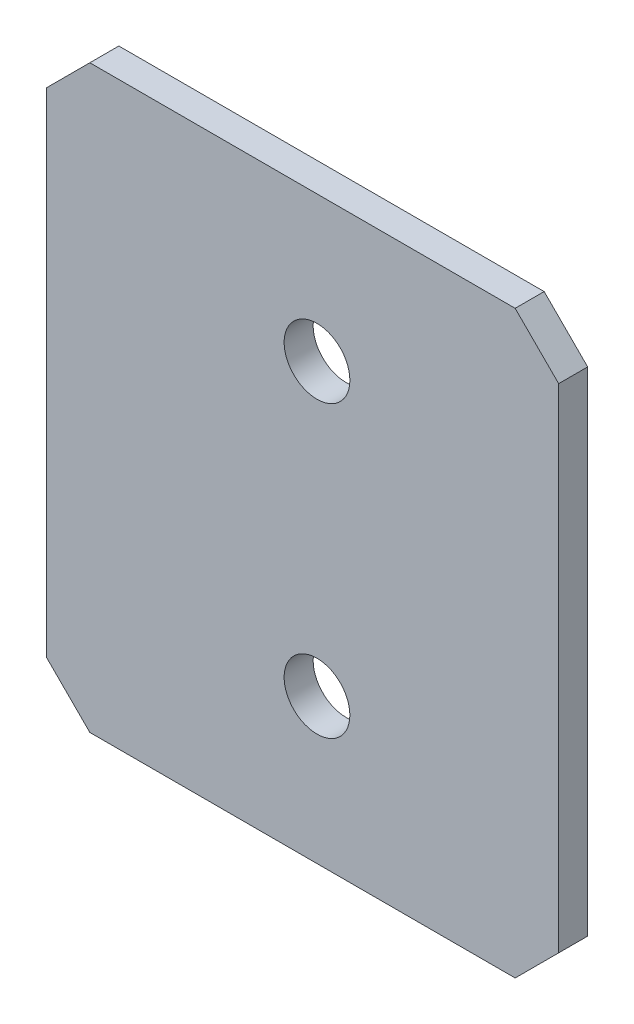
ISO-10303-21;
HEADER;
FILE_DESCRIPTION(('STEP AP214'),'2;1');
FILE_NAME('part.step','',(''),(''),'','','');
FILE_SCHEMA(('AUTOMOTIVE_DESIGN { 1 0 10303 214 1 1 1 1 }'));
ENDSEC;
DATA;
#1=APPLICATION_CONTEXT('core data for automotive mechanical design processes');
#2=APPLICATION_PROTOCOL_DEFINITION('international standard','automotive_design',2000,#1);
#3=PRODUCT_CONTEXT('',#1,'mechanical');
#4=PRODUCT('Part','Part','',(#3));
#5=PRODUCT_RELATED_PRODUCT_CATEGORY('part','',(#4));
#6=PRODUCT_DEFINITION_FORMATION('','',#4);
#7=PRODUCT_DEFINITION_CONTEXT('part definition',#1,'design');
#8=PRODUCT_DEFINITION('design','',#6,#7);
#9=PRODUCT_DEFINITION_SHAPE('','',#8);
#10=(LENGTH_UNIT() NAMED_UNIT(*) SI_UNIT(.MILLI.,.METRE.));
#11=(NAMED_UNIT(*) PLANE_ANGLE_UNIT() SI_UNIT($,.RADIAN.));
#12=(NAMED_UNIT(*) SI_UNIT($,.STERADIAN.) SOLID_ANGLE_UNIT());
#13=UNCERTAINTY_MEASURE_WITH_UNIT(LENGTH_MEASURE(1.E-05),#10,'distance_accuracy_value','');
#14=(GEOMETRIC_REPRESENTATION_CONTEXT(3) GLOBAL_UNCERTAINTY_ASSIGNED_CONTEXT((#13)) GLOBAL_UNIT_ASSIGNED_CONTEXT((#10,
#11,#12)) REPRESENTATION_CONTEXT('',''));
#15=CARTESIAN_POINT('',(0.,0.,0.));
#16=DIRECTION('',(0.,0.,1.));
#17=DIRECTION('',(1.,0.,0.));
#18=AXIS2_PLACEMENT_3D('',#15,#16,#17);
#19=CARTESIAN_POINT('',(0.,0.,3.));
#20=DIRECTION('',(1.,0.,0.));
#21=DIRECTION('',(0.,0.,-1.));
#22=AXIS2_PLACEMENT_3D('',#19,#20,#21);
#23=PLANE('',#22);
#24=DIRECTION('',(0.,-1.,0.));
#25=VECTOR('',#24,1.);
#26=CARTESIAN_POINT('',(0.,0.,3.));
#27=LINE('',#26,#25);
#28=CARTESIAN_POINT('',(0.,55.5,3.));
#29=VERTEX_POINT('',#28);
#30=CARTESIAN_POINT('',(0.,4.50000000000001,3.));
#31=VERTEX_POINT('',#30);
#32=EDGE_CURVE('E119',#29,#31,#27,.T.);
#33=ORIENTED_EDGE('',*,*,#32,.F.);
#34=DIRECTION('',(0.,0.,-1.));
#35=VECTOR('',#34,1.);
#36=CARTESIAN_POINT('',(0.,55.5,3.));
#37=LINE('',#36,#35);
#38=CARTESIAN_POINT('',(0.,55.5,0.));
#39=VERTEX_POINT('',#38);
#40=EDGE_CURVE('E104',#29,#39,#37,.T.);
#41=ORIENTED_EDGE('',*,*,#40,.T.);
#42=DIRECTION('',(0.,-1.,0.));
#43=VECTOR('',#42,1.);
#44=CARTESIAN_POINT('',(0.,0.,0.));
#45=LINE('',#44,#43);
#46=CARTESIAN_POINT('',(0.,4.50000000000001,0.));
#47=VERTEX_POINT('',#46);
#48=EDGE_CURVE('E116',#39,#47,#45,.T.);
#49=ORIENTED_EDGE('',*,*,#48,.T.);
#50=DIRECTION('',(0.,0.,1.));
#51=VECTOR('',#50,1.);
#52=CARTESIAN_POINT('',(0.,4.50000000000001,3.));
#53=LINE('',#52,#51);
#54=EDGE_CURVE('E121',#47,#31,#53,.T.);
#55=ORIENTED_EDGE('',*,*,#54,.T.);
#56=EDGE_LOOP('',(#33,#41,#49,#55));
#57=FACE_BOUND('',#56,.T.);
#58=ADVANCED_FACE('F34',(#57),#23,.F.);
#59=CARTESIAN_POINT('',(0.,0.,3.));
#60=DIRECTION('',(0.,1.,0.));
#61=DIRECTION('',(0.,0.,1.));
#62=AXIS2_PLACEMENT_3D('',#59,#60,#61);
#63=PLANE('',#62);
#64=DIRECTION('',(1.,0.,0.));
#65=VECTOR('',#64,1.);
#66=CARTESIAN_POINT('',(0.,0.,0.));
#67=LINE('',#66,#65);
#68=CARTESIAN_POINT('',(4.5,0.,0.));
#69=VERTEX_POINT('',#68);
#70=CARTESIAN_POINT('',(48.5,0.,0.));
#71=VERTEX_POINT('',#70);
#72=EDGE_CURVE('E125',#69,#71,#67,.T.);
#73=ORIENTED_EDGE('',*,*,#72,.T.);
#74=DIRECTION('',(0.,0.,1.));
#75=VECTOR('',#74,1.);
#76=CARTESIAN_POINT('',(48.5,0.,3.));
#77=LINE('',#76,#75);
#78=CARTESIAN_POINT('',(48.5,0.,3.));
#79=VERTEX_POINT('',#78);
#80=EDGE_CURVE('E11',#71,#79,#77,.T.);
#81=ORIENTED_EDGE('',*,*,#80,.T.);
#82=DIRECTION('',(1.,0.,0.));
#83=VECTOR('',#82,1.);
#84=CARTESIAN_POINT('',(0.,0.,3.));
#85=LINE('',#84,#83);
#86=CARTESIAN_POINT('',(4.49999999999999,0.,3.));
#87=VERTEX_POINT('',#86);
#88=EDGE_CURVE('E169',#87,#79,#85,.T.);
#89=ORIENTED_EDGE('',*,*,#88,.F.);
#90=DIRECTION('',(0.,0.,-1.));
#91=VECTOR('',#90,1.);
#92=CARTESIAN_POINT('',(4.49999999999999,0.,3.));
#93=LINE('',#92,#91);
#94=EDGE_CURVE('E42',#87,#69,#93,.T.);
#95=ORIENTED_EDGE('',*,*,#94,.T.);
#96=EDGE_LOOP('',(#73,#81,#89,#95));
#97=FACE_BOUND('',#96,.T.);
#98=ADVANCED_FACE('F167',(#97),#63,.F.);
#99=CARTESIAN_POINT('',(53.,0.,3.));
#100=DIRECTION('',(-1.,0.,0.));
#101=DIRECTION('',(0.,-1.,0.));
#102=AXIS2_PLACEMENT_3D('',#99,#100,#101);
#103=PLANE('',#102);
#104=DIRECTION('',(0.,1.,0.));
#105=VECTOR('',#104,1.);
#106=CARTESIAN_POINT('',(53.,0.,0.));
#107=LINE('',#106,#105);
#108=CARTESIAN_POINT('',(53.,4.5,0.));
#109=VERTEX_POINT('',#108);
#110=CARTESIAN_POINT('',(53.,55.5,0.));
#111=VERTEX_POINT('',#110);
#112=EDGE_CURVE('E129',#109,#111,#107,.T.);
#113=ORIENTED_EDGE('',*,*,#112,.T.);
#114=DIRECTION('',(0.,0.,1.));
#115=VECTOR('',#114,1.);
#116=CARTESIAN_POINT('',(53.,55.5,3.));
#117=LINE('',#116,#115);
#118=CARTESIAN_POINT('',(53.,55.5,3.));
#119=VERTEX_POINT('',#118);
#120=EDGE_CURVE('E49',#111,#119,#117,.T.);
#121=ORIENTED_EDGE('',*,*,#120,.T.);
#122=DIRECTION('',(0.,1.,0.));
#123=VECTOR('',#122,1.);
#124=CARTESIAN_POINT('',(53.,0.,3.));
#125=LINE('',#124,#123);
#126=CARTESIAN_POINT('',(53.,4.5,3.));
#127=VERTEX_POINT('',#126);
#128=EDGE_CURVE('E177',#127,#119,#125,.T.);
#129=ORIENTED_EDGE('',*,*,#128,.F.);
#130=DIRECTION('',(0.,0.,-1.));
#131=VECTOR('',#130,1.);
#132=CARTESIAN_POINT('',(53.,4.5,3.));
#133=LINE('',#132,#131);
#134=EDGE_CURVE('E160',#127,#109,#133,.T.);
#135=ORIENTED_EDGE('',*,*,#134,.T.);
#136=EDGE_LOOP('',(#113,#121,#129,#135));
#137=FACE_BOUND('',#136,.T.);
#138=ADVANCED_FACE('F176',(#137),#103,.F.);
#139=CARTESIAN_POINT('',(0.,60.,3.));
#140=DIRECTION('',(0.,-1.,0.));
#141=DIRECTION('',(0.,0.,-1.));
#142=AXIS2_PLACEMENT_3D('',#139,#140,#141);
#143=PLANE('',#142);
#144=DIRECTION('',(-1.,0.,0.));
#145=VECTOR('',#144,1.);
#146=CARTESIAN_POINT('',(0.,60.,0.));
#147=LINE('',#146,#145);
#148=CARTESIAN_POINT('',(48.5,60.,0.));
#149=VERTEX_POINT('',#148);
#150=CARTESIAN_POINT('',(4.50000000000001,60.,0.));
#151=VERTEX_POINT('',#150);
#152=EDGE_CURVE('E139',#149,#151,#147,.T.);
#153=ORIENTED_EDGE('',*,*,#152,.T.);
#154=DIRECTION('',(0.,0.,1.));
#155=VECTOR('',#154,1.);
#156=CARTESIAN_POINT('',(4.50000000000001,60.,3.));
#157=LINE('',#156,#155);
#158=CARTESIAN_POINT('',(4.50000000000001,60.,3.));
#159=VERTEX_POINT('',#158);
#160=EDGE_CURVE('E105',#151,#159,#157,.T.);
#161=ORIENTED_EDGE('',*,*,#160,.T.);
#162=DIRECTION('',(-1.,0.,0.));
#163=VECTOR('',#162,1.);
#164=CARTESIAN_POINT('',(0.,60.,3.));
#165=LINE('',#164,#163);
#166=CARTESIAN_POINT('',(48.5,60.,3.));
#167=VERTEX_POINT('',#166);
#168=EDGE_CURVE('E135',#167,#159,#165,.T.);
#169=ORIENTED_EDGE('',*,*,#168,.F.);
#170=DIRECTION('',(0.,0.,-1.));
#171=VECTOR('',#170,1.);
#172=CARTESIAN_POINT('',(48.5,60.,3.));
#173=LINE('',#172,#171);
#174=EDGE_CURVE('E110',#167,#149,#173,.T.);
#175=ORIENTED_EDGE('',*,*,#174,.T.);
#176=EDGE_LOOP('',(#153,#161,#169,#175));
#177=FACE_BOUND('',#176,.T.);
#178=ADVANCED_FACE('F193',(#177),#143,.F.);
#179=CARTESIAN_POINT('',(0.,60.,3.));
#180=DIRECTION('',(0.,0.,-1.));
#181=DIRECTION('',(-1.,0.,0.));
#182=AXIS2_PLACEMENT_3D('',#179,#180,#181);
#183=PLANE('',#182);
#184=CARTESIAN_POINT('',(28.,45.,3.));
#185=DIRECTION('',(0.,0.,1.));
#186=DIRECTION('',(1.,0.,0.));
#187=AXIS2_PLACEMENT_3D('',#184,#185,#186);
#188=CIRCLE('',#187,3.39999999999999);
#189=CARTESIAN_POINT('',(31.4,45.,3.));
#190=VERTEX_POINT('',#189);
#191=EDGE_CURVE('E144',#190,#190,#188,.T.);
#192=ORIENTED_EDGE('',*,*,#191,.F.);
#193=EDGE_LOOP('',(#192));
#194=FACE_BOUND('',#193,.T.);
#195=CARTESIAN_POINT('',(28.,15.,3.));
#196=DIRECTION('',(0.,0.,1.));
#197=DIRECTION('',(1.,0.,0.));
#198=AXIS2_PLACEMENT_3D('',#195,#196,#197);
#199=CIRCLE('',#198,3.4);
#200=CARTESIAN_POINT('',(31.4,15.,3.));
#201=VERTEX_POINT('',#200);
#202=EDGE_CURVE('E132',#201,#201,#199,.T.);
#203=ORIENTED_EDGE('',*,*,#202,.F.);
#204=EDGE_LOOP('',(#203));
#205=FACE_BOUND('',#204,.T.);
#206=ORIENTED_EDGE('',*,*,#168,.T.);
#207=DIRECTION('',(0.707106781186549,0.707106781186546,0.));
#208=VECTOR('',#207,1.);
#209=CARTESIAN_POINT('',(0.,55.5,3.));
#210=LINE('',#209,#208);
#211=EDGE_CURVE('E158',#159,#29,#210,.F.);
#212=ORIENTED_EDGE('',*,*,#211,.T.);
#213=ORIENTED_EDGE('',*,*,#32,.T.);
#214=DIRECTION('',(-0.707106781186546,0.707106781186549,0.));
#215=VECTOR('',#214,1.);
#216=CARTESIAN_POINT('',(4.49999999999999,0.,3.));
#217=LINE('',#216,#215);
#218=EDGE_CURVE('E153',#31,#87,#217,.F.);
#219=ORIENTED_EDGE('',*,*,#218,.T.);
#220=ORIENTED_EDGE('',*,*,#88,.T.);
#221=DIRECTION('',(-0.707106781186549,-0.707106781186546,0.));
#222=VECTOR('',#221,1.);
#223=CARTESIAN_POINT('',(53.,4.5,3.));
#224=LINE('',#223,#222);
#225=EDGE_CURVE('E56',#79,#127,#224,.F.);
#226=ORIENTED_EDGE('',*,*,#225,.T.);
#227=ORIENTED_EDGE('',*,*,#128,.T.);
#228=DIRECTION('',(0.707106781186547,-0.707106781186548,0.));
#229=VECTOR('',#228,1.);
#230=CARTESIAN_POINT('',(48.5,60.,3.));
#231=LINE('',#230,#229);
#232=EDGE_CURVE('E156',#119,#167,#231,.F.);
#233=ORIENTED_EDGE('',*,*,#232,.T.);
#234=EDGE_LOOP('',(#206,#212,#213,#219,#220,#226,#227,#233));
#235=FACE_BOUND('',#234,.T.);
#236=ADVANCED_FACE('F190',(#194,#205,#235),#183,.F.);
#237=CARTESIAN_POINT('',(0.,60.,0.));
#238=DIRECTION('',(0.,0.,-1.));
#239=DIRECTION('',(-1.,0.,0.));
#240=AXIS2_PLACEMENT_3D('',#237,#238,#239);
#241=PLANE('',#240);
#242=CARTESIAN_POINT('',(28.,45.,0.));
#243=DIRECTION('',(0.,0.,-1.));
#244=DIRECTION('',(-1.,0.,0.));
#245=AXIS2_PLACEMENT_3D('',#242,#243,#244);
#246=CIRCLE('',#245,3.39999999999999);
#247=CARTESIAN_POINT('',(24.6,45.,0.));
#248=VERTEX_POINT('',#247);
#249=EDGE_CURVE('E141',#248,#248,#246,.T.);
#250=ORIENTED_EDGE('',*,*,#249,.F.);
#251=EDGE_LOOP('',(#250));
#252=FACE_BOUND('',#251,.T.);
#253=CARTESIAN_POINT('',(28.,15.,0.));
#254=DIRECTION('',(0.,0.,-1.));
#255=DIRECTION('',(-1.,0.,0.));
#256=AXIS2_PLACEMENT_3D('',#253,#254,#255);
#257=CIRCLE('',#256,3.4);
#258=CARTESIAN_POINT('',(24.6,15.,0.));
#259=VERTEX_POINT('',#258);
#260=EDGE_CURVE('E126',#259,#259,#257,.T.);
#261=ORIENTED_EDGE('',*,*,#260,.F.);
#262=EDGE_LOOP('',(#261));
#263=FACE_BOUND('',#262,.T.);
#264=ORIENTED_EDGE('',*,*,#48,.F.);
#265=DIRECTION('',(-0.707106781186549,-0.707106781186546,0.));
#266=VECTOR('',#265,1.);
#267=CARTESIAN_POINT('',(2.25,57.75,0.));
#268=LINE('',#267,#266);
#269=EDGE_CURVE('E100',#39,#151,#268,.F.);
#270=ORIENTED_EDGE('',*,*,#269,.T.);
#271=ORIENTED_EDGE('',*,*,#152,.F.);
#272=DIRECTION('',(-0.707106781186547,0.707106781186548,0.));
#273=VECTOR('',#272,1.);
#274=CARTESIAN_POINT('',(24.25,84.25,0.));
#275=LINE('',#274,#273);
#276=EDGE_CURVE('E111',#149,#111,#275,.F.);
#277=ORIENTED_EDGE('',*,*,#276,.T.);
#278=ORIENTED_EDGE('',*,*,#112,.F.);
#279=DIRECTION('',(0.707106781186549,0.707106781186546,0.));
#280=VECTOR('',#279,1.);
#281=CARTESIAN_POINT('',(54.2499999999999,5.74999999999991,0.));
#282=LINE('',#281,#280);
#283=EDGE_CURVE('E147',#109,#71,#282,.F.);
#284=ORIENTED_EDGE('',*,*,#283,.T.);
#285=ORIENTED_EDGE('',*,*,#72,.F.);
#286=DIRECTION('',(0.707106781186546,-0.707106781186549,0.));
#287=VECTOR('',#286,1.);
#288=CARTESIAN_POINT('',(-27.75,32.2500000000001,0.));
#289=LINE('',#288,#287);
#290=EDGE_CURVE('E120',#69,#47,#289,.F.);
#291=ORIENTED_EDGE('',*,*,#290,.T.);
#292=EDGE_LOOP('',(#264,#270,#271,#277,#278,#284,#285,#291));
#293=FACE_BOUND('',#292,.T.);
#294=ADVANCED_FACE('F123',(#252,#263,#293),#241,.T.);
#295=CARTESIAN_POINT('',(28.,15.,3.));
#296=DIRECTION('',(0.,0.,1.));
#297=DIRECTION('',(1.,0.,0.));
#298=AXIS2_PLACEMENT_3D('',#295,#296,#297);
#299=CYLINDRICAL_SURFACE('',#298,3.4);
#300=ORIENTED_EDGE('',*,*,#260,.T.);
#301=EDGE_LOOP('',(#300));
#302=FACE_BOUND('',#301,.T.);
#303=ORIENTED_EDGE('',*,*,#202,.T.);
#304=EDGE_LOOP('',(#303));
#305=FACE_BOUND('',#304,.T.);
#306=ADVANCED_FACE('F220',(#302,#305),#299,.F.);
#307=CARTESIAN_POINT('',(28.,45.,3.));
#308=DIRECTION('',(0.,0.,1.));
#309=DIRECTION('',(1.,0.,0.));
#310=AXIS2_PLACEMENT_3D('',#307,#308,#309);
#311=CYLINDRICAL_SURFACE('',#310,3.39999999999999);
#312=ORIENTED_EDGE('',*,*,#249,.T.);
#313=EDGE_LOOP('',(#312));
#314=FACE_BOUND('',#313,.T.);
#315=ORIENTED_EDGE('',*,*,#191,.T.);
#316=EDGE_LOOP('',(#315));
#317=FACE_BOUND('',#316,.T.);
#318=ADVANCED_FACE('F188',(#314,#317),#311,.F.);
#319=CARTESIAN_POINT('',(0.,55.5,3.));
#320=DIRECTION('',(0.707106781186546,-0.707106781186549,0.));
#321=DIRECTION('',(0.707106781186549,0.707106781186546,0.));
#322=AXIS2_PLACEMENT_3D('',#319,#320,#321);
#323=PLANE('',#322);
#324=ORIENTED_EDGE('',*,*,#211,.F.);
#325=ORIENTED_EDGE('',*,*,#160,.F.);
#326=ORIENTED_EDGE('',*,*,#269,.F.);
#327=ORIENTED_EDGE('',*,*,#40,.F.);
#328=EDGE_LOOP('',(#324,#325,#326,#327));
#329=FACE_BOUND('',#328,.T.);
#330=ADVANCED_FACE('F103',(#329),#323,.F.);
#331=CARTESIAN_POINT('',(48.5,60.,3.));
#332=DIRECTION('',(-0.707106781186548,-0.707106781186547,0.));
#333=DIRECTION('',(0.707106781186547,-0.707106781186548,0.));
#334=AXIS2_PLACEMENT_3D('',#331,#332,#333);
#335=PLANE('',#334);
#336=ORIENTED_EDGE('',*,*,#232,.F.);
#337=ORIENTED_EDGE('',*,*,#120,.F.);
#338=ORIENTED_EDGE('',*,*,#276,.F.);
#339=ORIENTED_EDGE('',*,*,#174,.F.);
#340=EDGE_LOOP('',(#336,#337,#338,#339));
#341=FACE_BOUND('',#340,.T.);
#342=ADVANCED_FACE('F200',(#341),#335,.F.);
#343=CARTESIAN_POINT('',(53.,4.5,3.));
#344=DIRECTION('',(-0.707106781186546,0.707106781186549,0.));
#345=DIRECTION('',(-0.707106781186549,-0.707106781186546,0.));
#346=AXIS2_PLACEMENT_3D('',#343,#344,#345);
#347=PLANE('',#346);
#348=ORIENTED_EDGE('',*,*,#225,.F.);
#349=ORIENTED_EDGE('',*,*,#80,.F.);
#350=ORIENTED_EDGE('',*,*,#283,.F.);
#351=ORIENTED_EDGE('',*,*,#134,.F.);
#352=EDGE_LOOP('',(#348,#349,#350,#351));
#353=FACE_BOUND('',#352,.T.);
#354=ADVANCED_FACE('F175',(#353),#347,.F.);
#355=CARTESIAN_POINT('',(4.49999999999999,0.,3.));
#356=DIRECTION('',(0.707106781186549,0.707106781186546,0.));
#357=DIRECTION('',(-0.707106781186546,0.707106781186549,0.));
#358=AXIS2_PLACEMENT_3D('',#355,#356,#357);
#359=PLANE('',#358);
#360=ORIENTED_EDGE('',*,*,#218,.F.);
#361=ORIENTED_EDGE('',*,*,#54,.F.);
#362=ORIENTED_EDGE('',*,*,#290,.F.);
#363=ORIENTED_EDGE('',*,*,#94,.F.);
#364=EDGE_LOOP('',(#360,#361,#362,#363));
#365=FACE_BOUND('',#364,.T.);
#366=ADVANCED_FACE('F36',(#365),#359,.F.);
#367=CLOSED_SHELL('',(#58,#98,#138,#178,#236,#294,#306,#318,#330,#342,#354,#366));
#368=MANIFOLD_SOLID_BREP('B2',#367);
#369=ADVANCED_BREP_SHAPE_REPRESENTATION('',(#18,#368),#14);
#370=SHAPE_DEFINITION_REPRESENTATION(#9,#369);
ENDSEC;
END-ISO-10303-21;
